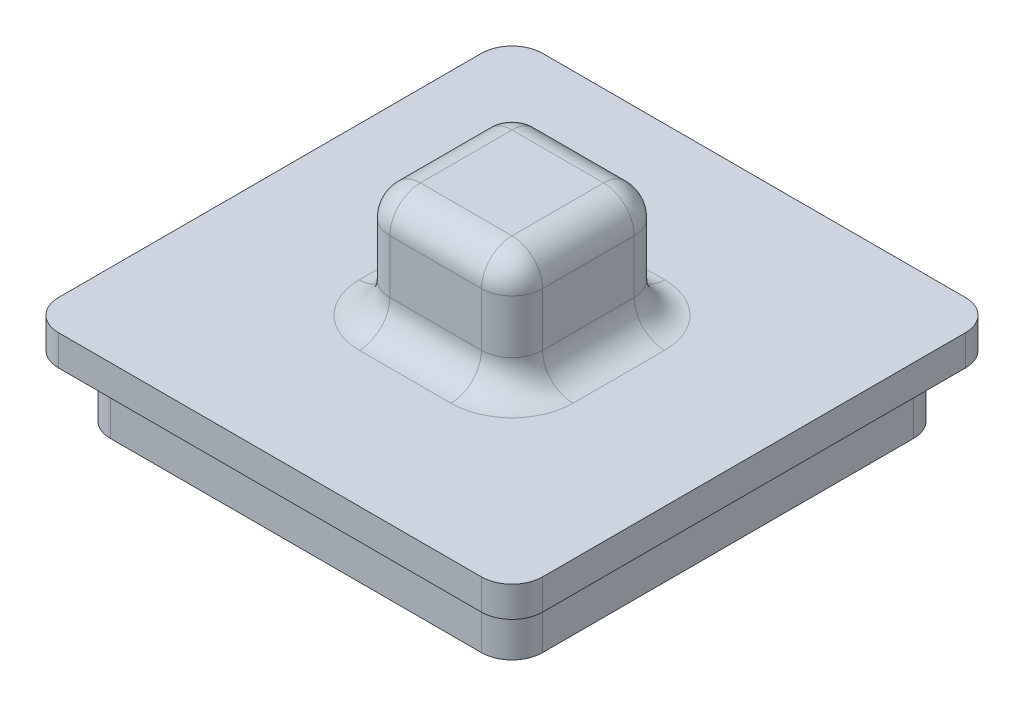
from build123d import *

# Parameters (mm, degrees)
SKETCH1_W           = 15.85
SKETCH1_H           = 15.85
BOSS_EXTRUDE1_DEPTH = 1
SKETCH2_W           = 14.15
SKETCH2_H           = 14.15
BOSS_EXTRUDE2_DEPTH = 2
SKETCH3_W           = 5
SKETCH3_H           = 5
BOSS_EXTRUDE3_DEPTH = 3.75
FILLET1_R           = 1


with BuildPart() as part:
    # Sketch1 → Boss-Extrude1 (new body)
    with BuildSketch(Plane(origin=(0, 0, 0), x_dir=(1, 0, 0), z_dir=(0, 1, 0))):
        Rectangle(SKETCH1_W, SKETCH1_H)
    extrude(amount=BOSS_EXTRUDE1_DEPTH)

    # Sketch2 → Boss-Extrude2 (add)
    with BuildSketch(Plane.XZ):
        Rectangle(SKETCH2_W, SKETCH2_H)
    extrude(amount=BOSS_EXTRUDE2_DEPTH)

    # Sketch3 → Boss-Extrude3 (add)
    with BuildSketch(Plane(origin=(0, 1, 0), x_dir=(1, 0, 0), z_dir=(0, 1, 0))):
        Rectangle(SKETCH3_W, SKETCH3_H)
    extrude(amount=BOSS_EXTRUDE3_DEPTH)

    # Fillet1
    fillet1_edges = [part.edges().sort_by_distance(p)[0] for p in [
        (7.075, -1, -7.075),
        (7.075, -1, 7.075),
        (-7.075, -1, 7.075),
        (-7.075, -1, -7.075),
        (2.5, 1, 0),
        (2.5, 2.875, 2.5),
        (0, 1, -2.5),
        (2.5, 2.875, -2.5),
        (-2.5, 1, 0),
        (-2.5, 2.875, -2.5),
        (0, 1, 2.5),
        (-2.5, 2.875, 2.5),
        (2.5, 4.75, 0),
        (0, 4.75, -2.5),
        (-2.5, 4.75, 0),
        (0, 4.75, 2.5),
        (7.925, 0.5, 7.925),
        (-7.925, 0.5, 7.925),
        (-7.925, 0.5, -7.925),
        (7.925, 0.5, -7.925),
    ]]
    fillet(fillet1_edges, radius=FILLET1_R)


solid = part.part
